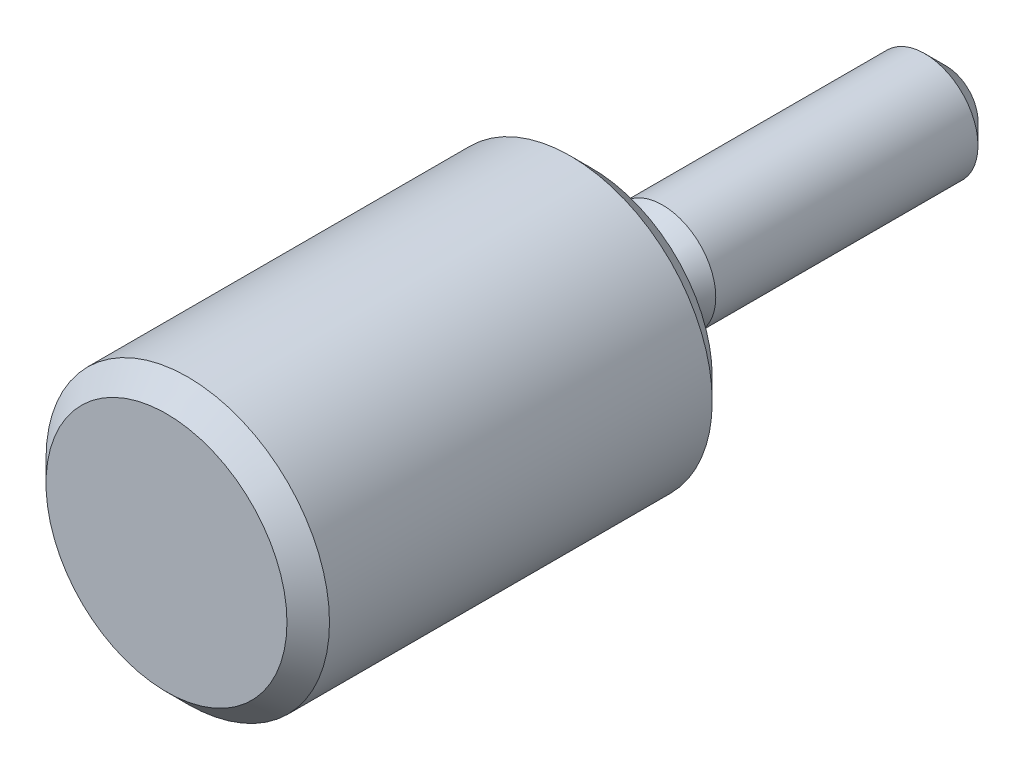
ISO-10303-21;
HEADER;
FILE_DESCRIPTION(('STEP AP214'),'2;1');
FILE_NAME('part.step','',(''),(''),'','','');
FILE_SCHEMA(('AUTOMOTIVE_DESIGN { 1 0 10303 214 1 1 1 1 }'));
ENDSEC;
DATA;
#1=APPLICATION_CONTEXT('core data for automotive mechanical design processes');
#2=APPLICATION_PROTOCOL_DEFINITION('international standard','automotive_design',2000,#1);
#3=PRODUCT_CONTEXT('',#1,'mechanical');
#4=PRODUCT('Part','Part','',(#3));
#5=PRODUCT_RELATED_PRODUCT_CATEGORY('part','',(#4));
#6=PRODUCT_DEFINITION_FORMATION('','',#4);
#7=PRODUCT_DEFINITION_CONTEXT('part definition',#1,'design');
#8=PRODUCT_DEFINITION('design','',#6,#7);
#9=PRODUCT_DEFINITION_SHAPE('','',#8);
#10=(LENGTH_UNIT() NAMED_UNIT(*) SI_UNIT(.MILLI.,.METRE.));
#11=(NAMED_UNIT(*) PLANE_ANGLE_UNIT() SI_UNIT($,.RADIAN.));
#12=(NAMED_UNIT(*) SI_UNIT($,.STERADIAN.) SOLID_ANGLE_UNIT());
#13=UNCERTAINTY_MEASURE_WITH_UNIT(LENGTH_MEASURE(1.E-05),#10,'distance_accuracy_value','');
#14=(GEOMETRIC_REPRESENTATION_CONTEXT(3) GLOBAL_UNCERTAINTY_ASSIGNED_CONTEXT((#13)) GLOBAL_UNIT_ASSIGNED_CONTEXT((#10,
#11,#12)) REPRESENTATION_CONTEXT('',''));
#15=CARTESIAN_POINT('',(0.,0.,0.));
#16=DIRECTION('',(0.,0.,1.));
#17=DIRECTION('',(1.,0.,0.));
#18=AXIS2_PLACEMENT_3D('',#15,#16,#17);
#19=CARTESIAN_POINT('',(0.,0.,12.));
#20=DIRECTION('',(0.,0.,-1.));
#21=DIRECTION('',(-1.,0.,0.));
#22=AXIS2_PLACEMENT_3D('',#19,#20,#21);
#23=CYLINDRICAL_SURFACE('',#22,4.);
#24=CARTESIAN_POINT('',(0.,0.,11.4));
#25=DIRECTION('',(0.,0.,1.));
#26=DIRECTION('',(1.,0.,0.));
#27=AXIS2_PLACEMENT_3D('',#24,#25,#26);
#28=CIRCLE('',#27,4.);
#29=CARTESIAN_POINT('',(4.,0.,11.4));
#30=VERTEX_POINT('',#29);
#31=EDGE_CURVE('E23',#30,#30,#28,.F.);
#32=ORIENTED_EDGE('',*,*,#31,.T.);
#33=EDGE_LOOP('',(#32));
#34=FACE_BOUND('',#33,.T.);
#35=CARTESIAN_POINT('',(0.,0.,0.6));
#36=DIRECTION('',(0.,0.,1.));
#37=DIRECTION('',(1.,0.,0.));
#38=AXIS2_PLACEMENT_3D('',#35,#36,#37);
#39=CIRCLE('',#38,4.);
#40=CARTESIAN_POINT('',(4.,0.,0.6));
#41=VERTEX_POINT('',#40);
#42=EDGE_CURVE('E35',#41,#41,#39,.T.);
#43=ORIENTED_EDGE('',*,*,#42,.T.);
#44=EDGE_LOOP('',(#43));
#45=FACE_BOUND('',#44,.T.);
#46=ADVANCED_FACE('F12',(#34,#45),#23,.T.);
#47=CARTESIAN_POINT('',(0.,0.,12.));
#48=DIRECTION('',(0.,0.,1.));
#49=DIRECTION('',(1.,0.,0.));
#50=AXIS2_PLACEMENT_3D('',#47,#48,#49);
#51=PLANE('',#50);
#52=CARTESIAN_POINT('',(0.,0.,12.));
#53=DIRECTION('',(0.,0.,1.));
#54=DIRECTION('',(1.,0.,0.));
#55=AXIS2_PLACEMENT_3D('',#52,#53,#54);
#56=CIRCLE('',#55,3.4);
#57=CARTESIAN_POINT('',(3.4,0.,12.));
#58=VERTEX_POINT('',#57);
#59=EDGE_CURVE('E27',#58,#58,#56,.T.);
#60=ORIENTED_EDGE('',*,*,#59,.T.);
#61=EDGE_LOOP('',(#60));
#62=FACE_BOUND('',#61,.T.);
#63=ADVANCED_FACE('F71',(#62),#51,.T.);
#64=CARTESIAN_POINT('',(0.,0.,0.));
#65=DIRECTION('',(0.,0.,1.));
#66=DIRECTION('',(1.,0.,0.));
#67=AXIS2_PLACEMENT_3D('',#64,#65,#66);
#68=PLANE('',#67);
#69=CARTESIAN_POINT('',(0.,0.,0.));
#70=DIRECTION('',(0.,0.,1.));
#71=DIRECTION('',(1.,0.,0.));
#72=AXIS2_PLACEMENT_3D('',#69,#70,#71);
#73=CIRCLE('',#72,3.4);
#74=CARTESIAN_POINT('',(3.4,0.,0.));
#75=VERTEX_POINT('',#74);
#76=EDGE_CURVE('E32',#75,#75,#73,.F.);
#77=ORIENTED_EDGE('',*,*,#76,.T.);
#78=EDGE_LOOP('',(#77));
#79=FACE_BOUND('',#78,.T.);
#80=CARTESIAN_POINT('',(0.,0.,0.));
#81=DIRECTION('',(0.,0.,1.));
#82=DIRECTION('',(1.,0.,0.));
#83=AXIS2_PLACEMENT_3D('',#80,#81,#82);
#84=CIRCLE('',#83,1.4);
#85=CARTESIAN_POINT('',(1.4,0.,0.));
#86=VERTEX_POINT('',#85);
#87=EDGE_CURVE('E41',#86,#86,#84,.T.);
#88=ORIENTED_EDGE('',*,*,#87,.T.);
#89=EDGE_LOOP('',(#88));
#90=FACE_BOUND('',#89,.T.);
#91=ADVANCED_FACE('F77',(#79,#90),#68,.F.);
#92=CARTESIAN_POINT('',(0.,0.,0.6));
#93=DIRECTION('',(0.,0.,1.));
#94=DIRECTION('',(1.,0.,0.));
#95=AXIS2_PLACEMENT_3D('',#92,#93,#94);
#96=CONICAL_SURFACE('',#95,4.,0.78539816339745);
#97=ORIENTED_EDGE('',*,*,#76,.F.);
#98=EDGE_LOOP('',(#97));
#99=FACE_BOUND('',#98,.T.);
#100=ORIENTED_EDGE('',*,*,#42,.F.);
#101=EDGE_LOOP('',(#100));
#102=FACE_BOUND('',#101,.T.);
#103=ADVANCED_FACE('F67',(#99,#102),#96,.T.);
#104=CARTESIAN_POINT('',(0.,0.,12.));
#105=DIRECTION('',(0.,0.,-1.));
#106=DIRECTION('',(-1.,0.,0.));
#107=AXIS2_PLACEMENT_3D('',#104,#105,#106);
#108=CONICAL_SURFACE('',#107,3.4,0.785398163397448);
#109=ORIENTED_EDGE('',*,*,#31,.F.);
#110=EDGE_LOOP('',(#109));
#111=FACE_BOUND('',#110,.T.);
#112=ORIENTED_EDGE('',*,*,#59,.F.);
#113=EDGE_LOOP('',(#112));
#114=FACE_BOUND('',#113,.T.);
#115=ADVANCED_FACE('F57',(#111,#114),#108,.T.);
#116=CARTESIAN_POINT('',(0.,0.,-1.21495579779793));
#117=DIRECTION('',(0.,0.,-1.));
#118=DIRECTION('',(-1.,0.,0.));
#119=AXIS2_PLACEMENT_3D('',#116,#117,#118);
#120=CONICAL_SURFACE('',#119,1.1,0.471238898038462);
#121=CARTESIAN_POINT('',(0.,0.,-2.));
#122=DIRECTION('',(0.,0.,1.));
#123=DIRECTION('',(1.,0.,0.));
#124=AXIS2_PLACEMENT_3D('',#121,#122,#123);
#125=CIRCLE('',#124,1.5);
#126=CARTESIAN_POINT('',(1.5,0.,-2.));
#127=VERTEX_POINT('',#126);
#128=EDGE_CURVE('E38',#127,#127,#125,.T.);
#129=ORIENTED_EDGE('',*,*,#128,.T.);
#130=EDGE_LOOP('',(#129));
#131=FACE_BOUND('',#130,.T.);
#132=CARTESIAN_POINT('',(0.,0.,-1.21495579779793));
#133=DIRECTION('',(0.,0.,1.));
#134=DIRECTION('',(1.,0.,0.));
#135=AXIS2_PLACEMENT_3D('',#132,#133,#134);
#136=CIRCLE('',#135,1.1);
#137=CARTESIAN_POINT('',(1.1,0.,-1.21495579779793));
#138=VERTEX_POINT('',#137);
#139=EDGE_CURVE('E47',#138,#138,#136,.T.);
#140=ORIENTED_EDGE('',*,*,#139,.F.);
#141=EDGE_LOOP('',(#140));
#142=FACE_BOUND('',#141,.T.);
#143=ADVANCED_FACE('F54',(#131,#142),#120,.T.);
#144=CARTESIAN_POINT('',(0.,0.,-0.3));
#145=DIRECTION('',(0.,0.,1.));
#146=DIRECTION('',(1.,0.,0.));
#147=AXIS2_PLACEMENT_3D('',#144,#145,#146);
#148=TOROIDAL_SURFACE('',#147,1.4,0.3);
#149=CARTESIAN_POINT('',(0.,0.,-0.3));
#150=DIRECTION('',(0.,0.,1.));
#151=DIRECTION('',(1.,0.,0.));
#152=AXIS2_PLACEMENT_3D('',#149,#150,#151);
#153=CIRCLE('',#152,1.1);
#154=CARTESIAN_POINT('',(1.1,0.,-0.3));
#155=VERTEX_POINT('',#154);
#156=EDGE_CURVE('E44',#155,#155,#153,.T.);
#157=ORIENTED_EDGE('',*,*,#156,.T.);
#158=EDGE_LOOP('',(#157));
#159=FACE_BOUND('',#158,.T.);
#160=ORIENTED_EDGE('',*,*,#87,.F.);
#161=EDGE_LOOP('',(#160));
#162=FACE_BOUND('',#161,.T.);
#163=ADVANCED_FACE('F56',(#159,#162),#148,.F.);
#164=CARTESIAN_POINT('',(0.,0.,0.));
#165=DIRECTION('',(0.,0.,1.));
#166=DIRECTION('',(1.,0.,0.));
#167=AXIS2_PLACEMENT_3D('',#164,#165,#166);
#168=CYLINDRICAL_SURFACE('',#167,1.1);
#169=ORIENTED_EDGE('',*,*,#139,.T.);
#170=EDGE_LOOP('',(#169));
#171=FACE_BOUND('',#170,.T.);
#172=ORIENTED_EDGE('',*,*,#156,.F.);
#173=EDGE_LOOP('',(#172));
#174=FACE_BOUND('',#173,.T.);
#175=ADVANCED_FACE('F51',(#171,#174),#168,.T.);
#176=CARTESIAN_POINT('',(0.,0.,-10.));
#177=DIRECTION('',(0.,0.,1.));
#178=DIRECTION('',(1.,0.,0.));
#179=AXIS2_PLACEMENT_3D('',#176,#177,#178);
#180=PLANE('',#179);
#181=CARTESIAN_POINT('',(0.,0.,-10.));
#182=DIRECTION('',(0.,0.,1.));
#183=DIRECTION('',(1.,0.,0.));
#184=AXIS2_PLACEMENT_3D('',#181,#182,#183);
#185=CIRCLE('',#184,0.9);
#186=CARTESIAN_POINT('',(0.9,0.,-10.));
#187=VERTEX_POINT('',#186);
#188=EDGE_CURVE('E8',#187,#187,#185,.F.);
#189=ORIENTED_EDGE('',*,*,#188,.T.);
#190=EDGE_LOOP('',(#189));
#191=FACE_BOUND('',#190,.T.);
#192=ADVANCED_FACE('F85',(#191),#180,.F.);
#193=CARTESIAN_POINT('',(0.,0.,-9.4));
#194=DIRECTION('',(0.,0.,1.));
#195=DIRECTION('',(1.,0.,0.));
#196=AXIS2_PLACEMENT_3D('',#193,#194,#195);
#197=CONICAL_SURFACE('',#196,1.5,0.78539816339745);
#198=ORIENTED_EDGE('',*,*,#188,.F.);
#199=EDGE_LOOP('',(#198));
#200=FACE_BOUND('',#199,.T.);
#201=CARTESIAN_POINT('',(0.,0.,-9.4));
#202=DIRECTION('',(0.,0.,1.));
#203=DIRECTION('',(1.,0.,0.));
#204=AXIS2_PLACEMENT_3D('',#201,#202,#203);
#205=CIRCLE('',#204,1.5);
#206=CARTESIAN_POINT('',(1.5,0.,-9.4));
#207=VERTEX_POINT('',#206);
#208=EDGE_CURVE('E19',#207,#207,#205,.T.);
#209=ORIENTED_EDGE('',*,*,#208,.F.);
#210=EDGE_LOOP('',(#209));
#211=FACE_BOUND('',#210,.T.);
#212=ADVANCED_FACE('F83',(#200,#211),#197,.T.);
#213=CARTESIAN_POINT('',(0.,0.,6.));
#214=DIRECTION('',(0.,0.,-1.));
#215=DIRECTION('',(-1.,0.,0.));
#216=AXIS2_PLACEMENT_3D('',#213,#214,#215);
#217=CYLINDRICAL_SURFACE('',#216,1.5);
#218=ORIENTED_EDGE('',*,*,#208,.T.);
#219=EDGE_LOOP('',(#218));
#220=FACE_BOUND('',#219,.T.);
#221=ORIENTED_EDGE('',*,*,#128,.F.);
#222=EDGE_LOOP('',(#221));
#223=FACE_BOUND('',#222,.T.);
#224=ADVANCED_FACE('F14',(#220,#223),#217,.T.);
#225=CLOSED_SHELL('',(#46,#63,#91,#103,#115,#143,#163,#175,#192,#212,#224));
#226=MANIFOLD_SOLID_BREP('B1',#225);
#227=ADVANCED_BREP_SHAPE_REPRESENTATION('',(#18,#226),#14);
#228=SHAPE_DEFINITION_REPRESENTATION(#9,#227);
ENDSEC;
END-ISO-10303-21;
